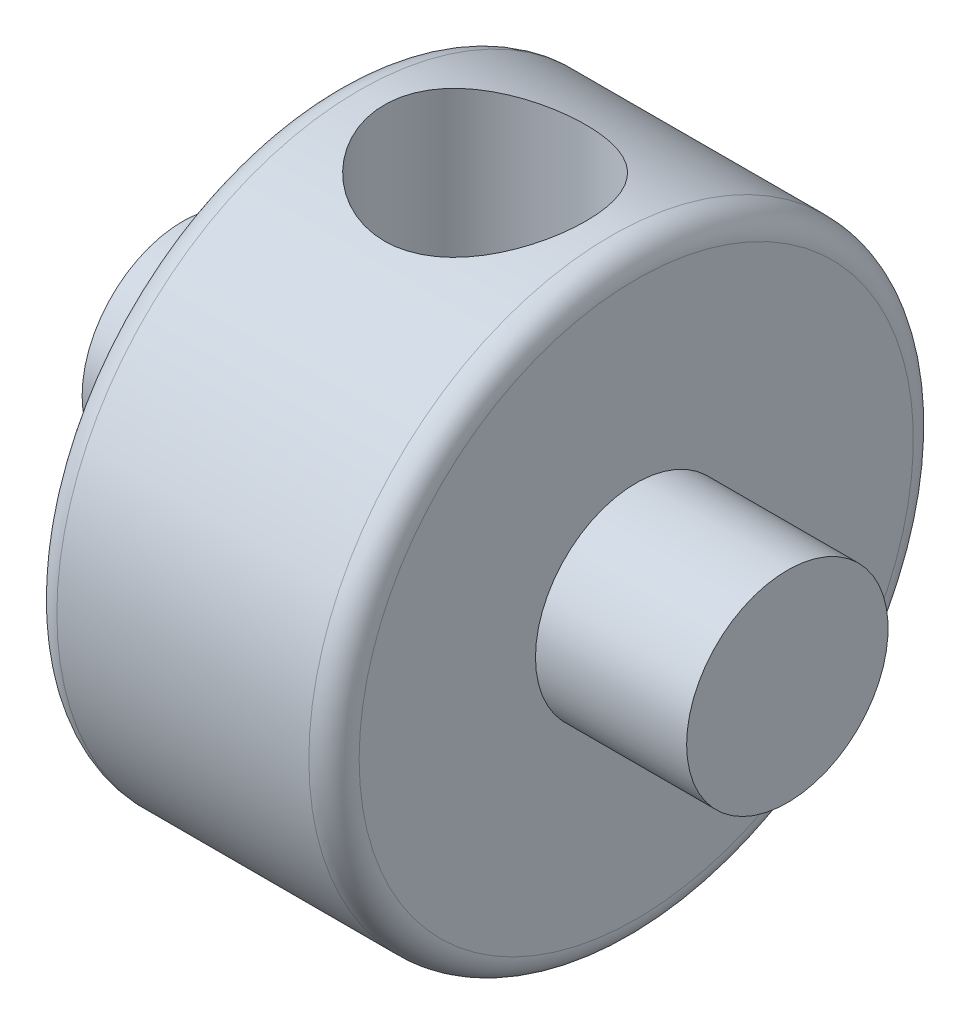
from build123d import *

# Parameters (mm, degrees)
FILLET1_R                    = 0.79248
F_97_0_0059_DIAMETER_HOLE1_D = 6.35


with BuildPart() as part:
    # Sketch1 → Revolve1 (revolve)
    with BuildSketch(Plane.XY, mode=Mode.PRIVATE) as revolve1_sk:
        Polygon((-9.525, 0), (-9.525, 3.175), (-4.7625, 3.175), (-4.7625, 9.525), (4.7625, 9.525), (4.7625, 3.175), (9.525, 3.175), (9.525, 0), align=None)
    revolve(revolve1_sk.sketch.rotate(Axis((-58.389715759, 0, 0), (1, 0, 0)), 90), axis=Axis((-58.389715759, 0, 0), (1, 0, 0)))

    # Fillet1
    fillet1_edges = [part.edges().sort_by_distance(p)[0] for p in [
        (4.7625, 0, -9.525),
        (-4.7625, 0, -9.525),
    ]]
    fillet(fillet1_edges, radius=FILLET1_R)

    # 97 _0.0059_ Diameter Hole1 (through all)
    with Locations(Plane.ZX.offset(9.525)):
        with Locations((0, 0)):
            Hole(F_97_0_0059_DIAMETER_HOLE1_D / 2)


solid = part.part
